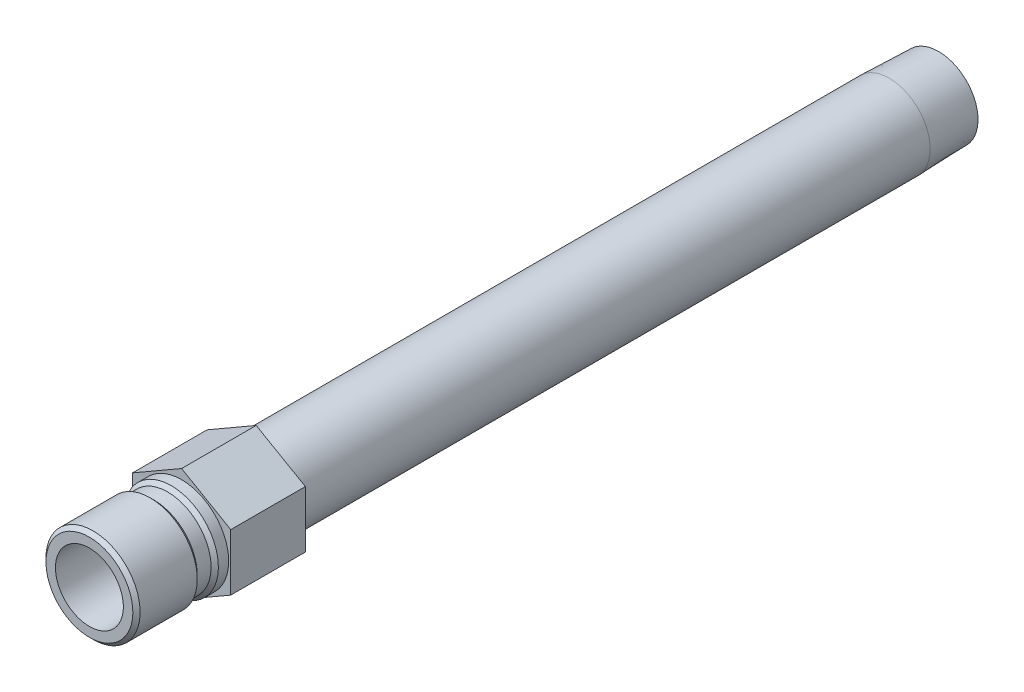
from build123d import *

# Parameters (mm, degrees)
SKETCH2_R           = 7.112
BOSS_EXTRUDE1_DEPTH = 15.621


with BuildPart() as part:
    # Sketch1 → Revolve1 (revolve)
    with BuildSketch(Plane(origin=(0, 0, 0), x_dir=(0, 0, -1), z_dir=(1, 0, 0))):
        Polygon((-19.304, 7.112), (-19.304, 9.0932), (-18.542, 9.8552), (-6.5786, 9.8552), (-5.8166, 9.0932), (-2.921, 9.0932), (-2.159, 9.8552), (0, 9.8552), (0, 8.5725), (148.1582, 8.5725), (158.496, 8.249445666), (158.496, 6.2611), (-1.071568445, 6.2611), (-1.524, 7.112), align=None)
    revolve(axis=Axis((0, 0, 0), (0, 0, 1)))

    # Sketch2 → Boss-Extrude1 (add)
    with BuildSketch(Plane.XY):
        Polygon((-10.287, 5.939202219), (-10.287, -5.939202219), (0, -11.878404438), (10.287, -5.939202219), (10.287, 5.939202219), (0, 11.878404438), align=None)
        with Locations(Location((0, 0, 0), (0, 0, 90))):
            Circle(SKETCH2_R, mode=Mode.SUBTRACT)
    extrude(amount=-BOSS_EXTRUDE1_DEPTH)


solid = part.part
